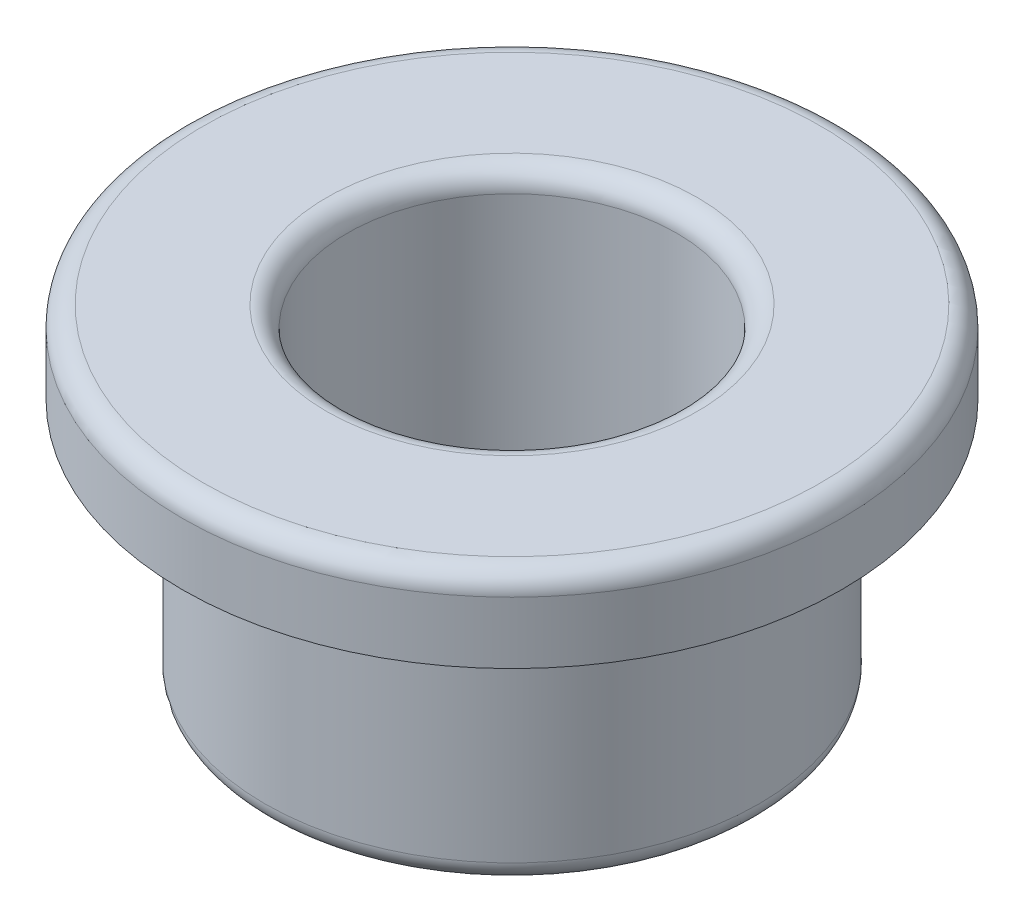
from build123d import *

# Parameters (mm, degrees)
CONG_1_R = 0.5


with BuildPart() as part:
    # Esquisse1 → R_volution1 (revolve)
    with BuildSketch(Plane.XY, mode=Mode.PRIVATE) as r_volution1_sk:
        Polygon((4, 0), (6, 0), (6, 6), (8, 6), (8, 8), (4, 8), align=None)
    revolve(r_volution1_sk.sketch.rotate(Axis((0, 0, 0), (0, 1, 0)), 90), axis=Axis((0, 0, 0), (0, 1, 0)))

    # Cong_1
    cong_1_edges = [part.edges().sort_by_distance(p)[0] for p in [
        (0, 0, 4),
        (0, 0, 6),
        (0, 6, 6),
        (0, 8, 8),
        (0, 8, 4),
    ]]
    fillet(cong_1_edges, radius=CONG_1_R)


solid = part.part
